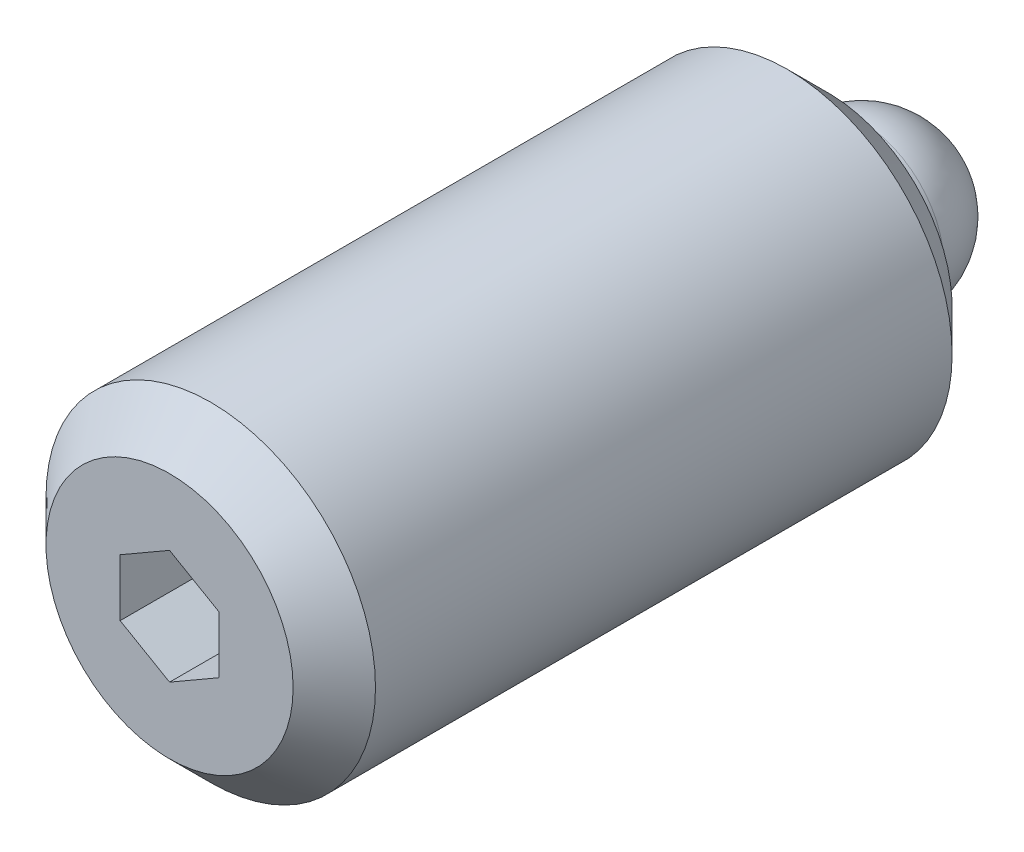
ISO-10303-21;
HEADER;
FILE_DESCRIPTION(('STEP AP214'),'2;1');
FILE_NAME('part.step','',(''),(''),'','','');
FILE_SCHEMA(('AUTOMOTIVE_DESIGN { 1 0 10303 214 1 1 1 1 }'));
ENDSEC;
DATA;
#1=APPLICATION_CONTEXT('core data for automotive mechanical design processes');
#2=APPLICATION_PROTOCOL_DEFINITION('international standard','automotive_design',2000,#1);
#3=PRODUCT_CONTEXT('',#1,'mechanical');
#4=PRODUCT('Part','Part','',(#3));
#5=PRODUCT_RELATED_PRODUCT_CATEGORY('part','',(#4));
#6=PRODUCT_DEFINITION_FORMATION('','',#4);
#7=PRODUCT_DEFINITION_CONTEXT('part definition',#1,'design');
#8=PRODUCT_DEFINITION('design','',#6,#7);
#9=PRODUCT_DEFINITION_SHAPE('','',#8);
#10=(LENGTH_UNIT() NAMED_UNIT(*) SI_UNIT(.MILLI.,.METRE.));
#11=(NAMED_UNIT(*) PLANE_ANGLE_UNIT() SI_UNIT($,.RADIAN.));
#12=(NAMED_UNIT(*) SI_UNIT($,.STERADIAN.) SOLID_ANGLE_UNIT());
#13=UNCERTAINTY_MEASURE_WITH_UNIT(LENGTH_MEASURE(1.E-05),#10,'distance_accuracy_value','');
#14=(GEOMETRIC_REPRESENTATION_CONTEXT(3) GLOBAL_UNCERTAINTY_ASSIGNED_CONTEXT((#13)) GLOBAL_UNIT_ASSIGNED_CONTEXT((#10,
#11,#12)) REPRESENTATION_CONTEXT('',''));
#15=CARTESIAN_POINT('',(0.,0.,0.));
#16=DIRECTION('',(0.,0.,1.));
#17=DIRECTION('',(1.,0.,0.));
#18=AXIS2_PLACEMENT_3D('',#15,#16,#17);
#19=CARTESIAN_POINT('',(0.,10.,47.));
#20=DIRECTION('',(0.,0.,1.));
#21=DIRECTION('',(1.,0.,0.));
#22=AXIS2_PLACEMENT_3D('',#19,#20,#21);
#23=PLANE('',#22);
#24=CARTESIAN_POINT('',(0.,0.,47.));
#25=DIRECTION('',(0.,0.,1.));
#26=DIRECTION('',(1.,0.,0.));
#27=AXIS2_PLACEMENT_3D('',#24,#25,#26);
#28=CIRCLE('',#27,7.5);
#29=CARTESIAN_POINT('',(7.5,0.,47.));
#30=VERTEX_POINT('',#29);
#31=EDGE_CURVE('E9',#30,#30,#28,.T.);
#32=ORIENTED_EDGE('',*,*,#31,.T.);
#33=EDGE_LOOP('',(#32));
#34=FACE_BOUND('',#33,.T.);
#35=DIRECTION('',(0.866025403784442,-0.499999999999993,0.));
#36=VECTOR('',#35,1.);
#37=CARTESIAN_POINT('',(-3.,-1.73205080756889,47.));
#38=LINE('',#37,#36);
#39=CARTESIAN_POINT('',(-3.,-1.73205080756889,47.));
#40=VERTEX_POINT('',#39);
#41=CARTESIAN_POINT('',(0.,-3.46410161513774,47.));
#42=VERTEX_POINT('',#41);
#43=EDGE_CURVE('E84',#40,#42,#38,.T.);
#44=ORIENTED_EDGE('',*,*,#43,.F.);
#45=DIRECTION('',(0.,1.,0.));
#46=VECTOR('',#45,1.);
#47=CARTESIAN_POINT('',(-3.,-1.73205080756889,47.));
#48=LINE('',#47,#46);
#49=CARTESIAN_POINT('',(-3.,1.73205080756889,47.));
#50=VERTEX_POINT('',#49);
#51=EDGE_CURVE('E29',#40,#50,#48,.T.);
#52=ORIENTED_EDGE('',*,*,#51,.T.);
#53=DIRECTION('',(0.866025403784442,0.499999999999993,0.));
#54=VECTOR('',#53,1.);
#55=CARTESIAN_POINT('',(-3.,1.73205080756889,47.));
#56=LINE('',#55,#54);
#57=CARTESIAN_POINT('',(0.,3.46410161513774,47.));
#58=VERTEX_POINT('',#57);
#59=EDGE_CURVE('E74',#50,#58,#56,.T.);
#60=ORIENTED_EDGE('',*,*,#59,.T.);
#61=DIRECTION('',(-0.866025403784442,0.499999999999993,0.));
#62=VECTOR('',#61,1.);
#63=CARTESIAN_POINT('',(3.,1.73205080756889,47.));
#64=LINE('',#63,#62);
#65=CARTESIAN_POINT('',(3.,1.73205080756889,47.));
#66=VERTEX_POINT('',#65);
#67=EDGE_CURVE('E79',#66,#58,#64,.T.);
#68=ORIENTED_EDGE('',*,*,#67,.F.);
#69=DIRECTION('',(0.,1.,0.));
#70=VECTOR('',#69,1.);
#71=CARTESIAN_POINT('',(3.,-1.73205080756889,47.));
#72=LINE('',#71,#70);
#73=CARTESIAN_POINT('',(3.,-1.73205080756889,47.));
#74=VERTEX_POINT('',#73);
#75=EDGE_CURVE('E88',#74,#66,#72,.T.);
#76=ORIENTED_EDGE('',*,*,#75,.F.);
#77=DIRECTION('',(-0.866025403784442,-0.499999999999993,0.));
#78=VECTOR('',#77,1.);
#79=CARTESIAN_POINT('',(3.,-1.73205080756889,47.));
#80=LINE('',#79,#78);
#81=EDGE_CURVE('E91',#74,#42,#80,.T.);
#82=ORIENTED_EDGE('',*,*,#81,.T.);
#83=EDGE_LOOP('',(#44,#52,#60,#68,#76,#82));
#84=FACE_BOUND('',#83,.T.);
#85=ADVANCED_FACE('F14',(#34,#84),#23,.T.);
#86=CARTESIAN_POINT('',(0.,0.,5.));
#87=DIRECTION('',(-1.,0.,0.));
#88=DIRECTION('',(0.,0.,1.));
#89=AXIS2_PLACEMENT_3D('',#86,#87,#88);
#90=SPHERICAL_SURFACE('',#89,5.);
#91=CARTESIAN_POINT('',(0.,0.,5.));
#92=DIRECTION('',(0.,0.,-1.));
#93=DIRECTION('',(-1.,0.,0.));
#94=AXIS2_PLACEMENT_3D('',#91,#92,#93);
#95=SPHERICAL_SURFACE('',#94,5.);
#96=CARTESIAN_POINT('',(0.,0.,5.));
#97=DIRECTION('',(0.,0.,-1.));
#98=DIRECTION('',(-1.,0.,0.));
#99=AXIS2_PLACEMENT_3D('',#96,#97,#98);
#100=CIRCLE('',#99,5.);
#101=CARTESIAN_POINT('',(-5.,0.,5.));
#102=VERTEX_POINT('',#101);
#103=EDGE_CURVE('E70',#102,#102,#100,.T.);
#104=ORIENTED_EDGE('',*,*,#103,.T.);
#105=EDGE_LOOP('',(#104));
#106=FACE_BOUND('',#105,.T.);
#107=ADVANCED_FACE('F152',(#106),#95,.T.);
#108=CARTESIAN_POINT('',(0.,0.,-8.));
#109=DIRECTION('',(0.,0.,-1.));
#110=DIRECTION('',(-1.,0.,0.));
#111=AXIS2_PLACEMENT_3D('',#108,#109,#110);
#112=CYLINDRICAL_SURFACE('',#111,10.);
#113=CARTESIAN_POINT('',(0.,0.,9.5));
#114=DIRECTION('',(0.,0.,-1.));
#115=DIRECTION('',(-1.,0.,0.));
#116=AXIS2_PLACEMENT_3D('',#113,#114,#115);
#117=CIRCLE('',#116,10.);
#118=CARTESIAN_POINT('',(-10.,0.,9.5));
#119=VERTEX_POINT('',#118);
#120=EDGE_CURVE('E22',#119,#119,#117,.F.);
#121=ORIENTED_EDGE('',*,*,#120,.T.);
#122=EDGE_LOOP('',(#121));
#123=FACE_BOUND('',#122,.T.);
#124=CARTESIAN_POINT('',(0.,0.,44.5));
#125=DIRECTION('',(0.,0.,1.));
#126=DIRECTION('',(1.,0.,0.));
#127=AXIS2_PLACEMENT_3D('',#124,#125,#126);
#128=CIRCLE('',#127,10.);
#129=CARTESIAN_POINT('',(10.,0.,44.5));
#130=VERTEX_POINT('',#129);
#131=EDGE_CURVE('E125',#130,#130,#128,.F.);
#132=ORIENTED_EDGE('',*,*,#131,.T.);
#133=EDGE_LOOP('',(#132));
#134=FACE_BOUND('',#133,.T.);
#135=ADVANCED_FACE('F130',(#123,#134),#112,.T.);
#136=CARTESIAN_POINT('',(0.,5.,7.));
#137=DIRECTION('',(0.,0.,-1.));
#138=DIRECTION('',(-1.,0.,0.));
#139=AXIS2_PLACEMENT_3D('',#136,#137,#138);
#140=PLANE('',#139);
#141=CARTESIAN_POINT('',(0.,0.,7.));
#142=DIRECTION('',(0.,0.,-1.));
#143=DIRECTION('',(-1.,0.,0.));
#144=AXIS2_PLACEMENT_3D('',#141,#142,#143);
#145=CIRCLE('',#144,7.5);
#146=CARTESIAN_POINT('',(-7.5,0.,7.));
#147=VERTEX_POINT('',#146);
#148=EDGE_CURVE('E122',#147,#147,#145,.T.);
#149=ORIENTED_EDGE('',*,*,#148,.T.);
#150=EDGE_LOOP('',(#149));
#151=FACE_BOUND('',#150,.T.);
#152=CARTESIAN_POINT('',(0.,0.,7.));
#153=DIRECTION('',(0.,0.,-1.));
#154=DIRECTION('',(-1.,0.,0.));
#155=AXIS2_PLACEMENT_3D('',#152,#153,#154);
#156=CIRCLE('',#155,5.);
#157=CARTESIAN_POINT('',(-5.,0.,7.));
#158=VERTEX_POINT('',#157);
#159=EDGE_CURVE('E119',#158,#158,#156,.T.);
#160=ORIENTED_EDGE('',*,*,#159,.F.);
#161=EDGE_LOOP('',(#160));
#162=FACE_BOUND('',#161,.T.);
#163=ADVANCED_FACE('F140',(#151,#162),#140,.T.);
#164=CARTESIAN_POINT('',(0.,0.,-8.));
#165=DIRECTION('',(0.,0.,-1.));
#166=DIRECTION('',(-1.,0.,0.));
#167=AXIS2_PLACEMENT_3D('',#164,#165,#166);
#168=CYLINDRICAL_SURFACE('',#167,5.);
#169=ORIENTED_EDGE('',*,*,#159,.T.);
#170=EDGE_LOOP('',(#169));
#171=FACE_BOUND('',#170,.T.);
#172=ORIENTED_EDGE('',*,*,#103,.F.);
#173=EDGE_LOOP('',(#172));
#174=FACE_BOUND('',#173,.T.);
#175=ADVANCED_FACE('F143',(#171,#174),#168,.T.);
#176=CARTESIAN_POINT('',(-3.,-1.73205080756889,39.));
#177=DIRECTION('',(1.,0.,0.));
#178=DIRECTION('',(0.,0.,-1.));
#179=AXIS2_PLACEMENT_3D('',#176,#177,#178);
#180=PLANE('',#179);
#181=DIRECTION('',(0.,0.,1.));
#182=VECTOR('',#181,1.);
#183=CARTESIAN_POINT('',(-3.,1.73205080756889,39.));
#184=LINE('',#183,#182);
#185=CARTESIAN_POINT('',(-3.,1.73205080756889,39.));
#186=VERTEX_POINT('',#185);
#187=EDGE_CURVE('E63',#186,#50,#184,.T.);
#188=ORIENTED_EDGE('',*,*,#187,.T.);
#189=ORIENTED_EDGE('',*,*,#51,.F.);
#190=DIRECTION('',(0.,0.,1.));
#191=VECTOR('',#190,1.);
#192=CARTESIAN_POINT('',(-3.,-1.73205080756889,39.));
#193=LINE('',#192,#191);
#194=CARTESIAN_POINT('',(-3.,-1.73205080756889,39.));
#195=VERTEX_POINT('',#194);
#196=EDGE_CURVE('E33',#195,#40,#193,.T.);
#197=ORIENTED_EDGE('',*,*,#196,.F.);
#198=DIRECTION('',(0.,1.,0.));
#199=VECTOR('',#198,1.);
#200=CARTESIAN_POINT('',(-3.,-1.73205080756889,39.));
#201=LINE('',#200,#199);
#202=EDGE_CURVE('E66',#195,#186,#201,.T.);
#203=ORIENTED_EDGE('',*,*,#202,.T.);
#204=EDGE_LOOP('',(#188,#189,#197,#203));
#205=FACE_BOUND('',#204,.T.);
#206=ADVANCED_FACE('F65',(#205),#180,.T.);
#207=CARTESIAN_POINT('',(-3.,1.73205080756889,39.));
#208=DIRECTION('',(0.499999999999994,-0.866025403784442,0.));
#209=DIRECTION('',(0.866025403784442,0.499999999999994,0.));
#210=AXIS2_PLACEMENT_3D('',#207,#208,#209);
#211=PLANE('',#210);
#212=DIRECTION('',(0.,0.,1.));
#213=VECTOR('',#212,1.);
#214=CARTESIAN_POINT('',(0.,3.46410161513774,39.));
#215=LINE('',#214,#213);
#216=CARTESIAN_POINT('',(0.,3.46410161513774,39.));
#217=VERTEX_POINT('',#216);
#218=EDGE_CURVE('E71',#217,#58,#215,.T.);
#219=ORIENTED_EDGE('',*,*,#218,.T.);
#220=ORIENTED_EDGE('',*,*,#59,.F.);
#221=ORIENTED_EDGE('',*,*,#187,.F.);
#222=DIRECTION('',(0.866025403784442,0.499999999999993,0.));
#223=VECTOR('',#222,1.);
#224=CARTESIAN_POINT('',(-3.,1.73205080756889,39.));
#225=LINE('',#224,#223);
#226=EDGE_CURVE('E95',#186,#217,#225,.T.);
#227=ORIENTED_EDGE('',*,*,#226,.T.);
#228=EDGE_LOOP('',(#219,#220,#221,#227));
#229=FACE_BOUND('',#228,.T.);
#230=ADVANCED_FACE('F75',(#229),#211,.T.);
#231=CARTESIAN_POINT('',(3.,1.73205080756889,39.));
#232=DIRECTION('',(0.499999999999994,0.866025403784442,0.));
#233=DIRECTION('',(-0.866025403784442,0.499999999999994,0.));
#234=AXIS2_PLACEMENT_3D('',#231,#232,#233);
#235=PLANE('',#234);
#236=DIRECTION('',(0.,0.,1.));
#237=VECTOR('',#236,1.);
#238=CARTESIAN_POINT('',(3.,1.73205080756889,39.));
#239=LINE('',#238,#237);
#240=CARTESIAN_POINT('',(3.,1.73205080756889,39.));
#241=VERTEX_POINT('',#240);
#242=EDGE_CURVE('E114',#241,#66,#239,.T.);
#243=ORIENTED_EDGE('',*,*,#242,.T.);
#244=ORIENTED_EDGE('',*,*,#67,.T.);
#245=ORIENTED_EDGE('',*,*,#218,.F.);
#246=DIRECTION('',(-0.866025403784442,0.499999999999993,0.));
#247=VECTOR('',#246,1.);
#248=CARTESIAN_POINT('',(3.,1.73205080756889,39.));
#249=LINE('',#248,#247);
#250=EDGE_CURVE('E97',#241,#217,#249,.T.);
#251=ORIENTED_EDGE('',*,*,#250,.F.);
#252=EDGE_LOOP('',(#243,#244,#245,#251));
#253=FACE_BOUND('',#252,.T.);
#254=ADVANCED_FACE('F167',(#253),#235,.F.);
#255=CARTESIAN_POINT('',(3.,-1.73205080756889,39.));
#256=DIRECTION('',(1.,0.,0.));
#257=DIRECTION('',(0.,0.,-1.));
#258=AXIS2_PLACEMENT_3D('',#255,#256,#257);
#259=PLANE('',#258);
#260=DIRECTION('',(0.,0.,1.));
#261=VECTOR('',#260,1.);
#262=CARTESIAN_POINT('',(3.,-1.73205080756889,39.));
#263=LINE('',#262,#261);
#264=CARTESIAN_POINT('',(3.,-1.73205080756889,39.));
#265=VERTEX_POINT('',#264);
#266=EDGE_CURVE('E112',#265,#74,#263,.T.);
#267=ORIENTED_EDGE('',*,*,#266,.T.);
#268=ORIENTED_EDGE('',*,*,#75,.T.);
#269=ORIENTED_EDGE('',*,*,#242,.F.);
#270=DIRECTION('',(0.,1.,0.));
#271=VECTOR('',#270,1.);
#272=CARTESIAN_POINT('',(3.,-1.73205080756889,39.));
#273=LINE('',#272,#271);
#274=EDGE_CURVE('E100',#265,#241,#273,.T.);
#275=ORIENTED_EDGE('',*,*,#274,.F.);
#276=EDGE_LOOP('',(#267,#268,#269,#275));
#277=FACE_BOUND('',#276,.T.);
#278=ADVANCED_FACE('F170',(#277),#259,.F.);
#279=CARTESIAN_POINT('',(3.,-1.73205080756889,39.));
#280=DIRECTION('',(-0.499999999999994,0.866025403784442,0.));
#281=DIRECTION('',(-0.866025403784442,-0.499999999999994,0.));
#282=AXIS2_PLACEMENT_3D('',#279,#280,#281);
#283=PLANE('',#282);
#284=DIRECTION('',(0.,0.,1.));
#285=VECTOR('',#284,1.);
#286=CARTESIAN_POINT('',(0.,-3.46410161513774,39.));
#287=LINE('',#286,#285);
#288=CARTESIAN_POINT('',(0.,-3.46410161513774,39.));
#289=VERTEX_POINT('',#288);
#290=EDGE_CURVE('E110',#289,#42,#287,.T.);
#291=ORIENTED_EDGE('',*,*,#290,.T.);
#292=ORIENTED_EDGE('',*,*,#81,.F.);
#293=ORIENTED_EDGE('',*,*,#266,.F.);
#294=DIRECTION('',(-0.866025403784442,-0.499999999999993,0.));
#295=VECTOR('',#294,1.);
#296=CARTESIAN_POINT('',(3.,-1.73205080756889,39.));
#297=LINE('',#296,#295);
#298=EDGE_CURVE('E103',#265,#289,#297,.T.);
#299=ORIENTED_EDGE('',*,*,#298,.T.);
#300=EDGE_LOOP('',(#291,#292,#293,#299));
#301=FACE_BOUND('',#300,.T.);
#302=ADVANCED_FACE('F174',(#301),#283,.T.);
#303=CARTESIAN_POINT('',(-3.,-1.73205080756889,39.));
#304=DIRECTION('',(-0.499999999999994,-0.866025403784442,0.));
#305=DIRECTION('',(0.866025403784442,-0.499999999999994,0.));
#306=AXIS2_PLACEMENT_3D('',#303,#304,#305);
#307=PLANE('',#306);
#308=DIRECTION('',(0.866025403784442,-0.499999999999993,0.));
#309=VECTOR('',#308,1.);
#310=CARTESIAN_POINT('',(-3.,-1.73205080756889,39.));
#311=LINE('',#310,#309);
#312=EDGE_CURVE('E106',#195,#289,#311,.T.);
#313=ORIENTED_EDGE('',*,*,#312,.F.);
#314=ORIENTED_EDGE('',*,*,#196,.T.);
#315=ORIENTED_EDGE('',*,*,#43,.T.);
#316=ORIENTED_EDGE('',*,*,#290,.F.);
#317=EDGE_LOOP('',(#313,#314,#315,#316));
#318=FACE_BOUND('',#317,.T.);
#319=ADVANCED_FACE('F137',(#318),#307,.F.);
#320=CARTESIAN_POINT('',(-3.,1.73205080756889,39.));
#321=DIRECTION('',(0.,0.,-1.));
#322=DIRECTION('',(-1.,0.,0.));
#323=AXIS2_PLACEMENT_3D('',#320,#321,#322);
#324=PLANE('',#323);
#325=ORIENTED_EDGE('',*,*,#202,.F.);
#326=ORIENTED_EDGE('',*,*,#312,.T.);
#327=ORIENTED_EDGE('',*,*,#298,.F.);
#328=ORIENTED_EDGE('',*,*,#274,.T.);
#329=ORIENTED_EDGE('',*,*,#250,.T.);
#330=ORIENTED_EDGE('',*,*,#226,.F.);
#331=EDGE_LOOP('',(#325,#326,#327,#328,#329,#330));
#332=FACE_BOUND('',#331,.T.);
#333=ADVANCED_FACE('F136',(#332),#324,.F.);
#334=CARTESIAN_POINT('',(0.,0.,7.));
#335=DIRECTION('',(0.,0.,1.));
#336=DIRECTION('',(1.,0.,0.));
#337=AXIS2_PLACEMENT_3D('',#334,#335,#336);
#338=CONICAL_SURFACE('',#337,7.5,0.785398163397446);
#339=ORIENTED_EDGE('',*,*,#120,.F.);
#340=EDGE_LOOP('',(#339));
#341=FACE_BOUND('',#340,.T.);
#342=ORIENTED_EDGE('',*,*,#148,.F.);
#343=EDGE_LOOP('',(#342));
#344=FACE_BOUND('',#343,.T.);
#345=ADVANCED_FACE('F133',(#341,#344),#338,.T.);
#346=CARTESIAN_POINT('',(0.,0.,44.5));
#347=DIRECTION('',(0.,0.,-1.));
#348=DIRECTION('',(-1.,0.,0.));
#349=AXIS2_PLACEMENT_3D('',#346,#347,#348);
#350=CONICAL_SURFACE('',#349,10.,0.785398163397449);
#351=ORIENTED_EDGE('',*,*,#31,.F.);
#352=EDGE_LOOP('',(#351));
#353=FACE_BOUND('',#352,.T.);
#354=ORIENTED_EDGE('',*,*,#131,.F.);
#355=EDGE_LOOP('',(#354));
#356=FACE_BOUND('',#355,.T.);
#357=ADVANCED_FACE('F16',(#353,#356),#350,.T.);
#358=CLOSED_SHELL('',(#85,#107,#135,#163,#175,#206,#230,#254,#278,#302,#319,#333,#345,#357));
#359=MANIFOLD_SOLID_BREP('B1',#358);
#360=ADVANCED_BREP_SHAPE_REPRESENTATION('',(#18,#359),#14);
#361=SHAPE_DEFINITION_REPRESENTATION(#9,#360);
ENDSEC;
END-ISO-10303-21;
